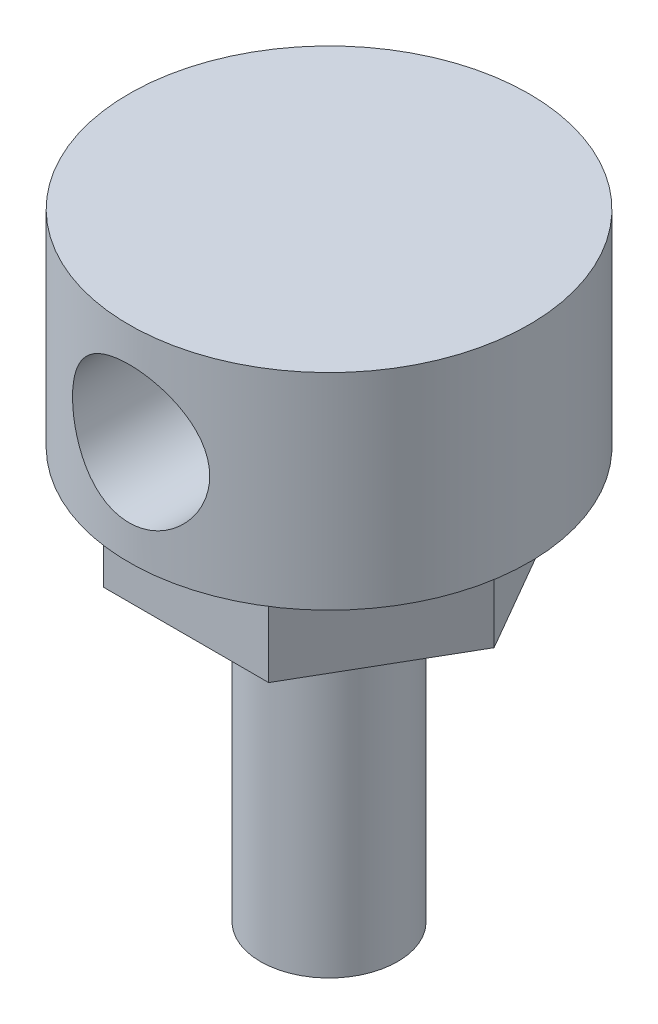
from build123d import *

# Parameters (mm, degrees)
BOSS_EXTRUDE1_DEPTH        = 8
SKETCH2_R                  = 17.5
BOSS_EXTRUDE2_DEPTH        = 18
SKETCH3_R                  = 6
BOSS_EXTRUDE3_DEPTH        = 28
CUT_EXTRUDE1_DEPTH         = 38.369773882
CUT_EXTRUDE1_DEPTH_BACK    = 38.369773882
SKETCH4_R                  = 6
M10X1_5_TAPPED_HOLE1_D     = 8.5
M10X1_5_TAPPED_HOLE1_DEPTH = 20
M10X1_5_TAPPED_HOLE1_TIP   = 2.553657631


with BuildPart() as part:
    # Sketch1 → Boss-Extrude1 (new body)
    with BuildSketch(Plane(origin=(0, 0, 0), x_dir=(1, 0, 0), z_dir=(0, 1, 0))):
        Polygon((14.43375673, 0), (7.216878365, 12.5), (-7.216878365, 12.5), (-14.43375673, 0), (-7.216878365, -12.5), (7.216878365, -12.5), align=None)
    extrude(amount=BOSS_EXTRUDE1_DEPTH)

    # Sketch2 → Boss-Extrude2 (add)
    with BuildSketch(Plane.XZ.offset(-8)):
        with Locations(Location((0, 0, 0), (0, 0, 270))):
            Circle(SKETCH2_R)
    extrude(amount=-BOSS_EXTRUDE2_DEPTH)

    # Sketch3 → Boss-Extrude3 (add)
    with BuildSketch(Plane(origin=(0, 0, 0), x_dir=(1, 0, 0), z_dir=(0, 1, 0))):
        with Locations(Location((0, 0, 0), (0, 0, 270))):
            Circle(SKETCH3_R)
    extrude(amount=-BOSS_EXTRUDE3_DEPTH)

    # Sketch4 → Cut-Extrude1 (cut, two sides: drawn at the far end of the back side and taken through both)
    with BuildSketch(Plane.XY.offset(-CUT_EXTRUDE1_DEPTH_BACK)):
        with Locations((0, 17)):
            Circle(SKETCH4_R)
    extrude(amount=CUT_EXTRUDE1_DEPTH + CUT_EXTRUDE1_DEPTH_BACK, mode=Mode.SUBTRACT)

    # M10x1.5 Tapped Hole1
    with Locations(Plane(origin=(0, -28, 0), x_dir=(-1, 0, 0), z_dir=(0, -1, 0))):
        with Locations((0, 0)):
            Hole(M10X1_5_TAPPED_HOLE1_D / 2, depth=M10X1_5_TAPPED_HOLE1_DEPTH)
            with Locations((0, 0, -(M10X1_5_TAPPED_HOLE1_DEPTH + M10X1_5_TAPPED_HOLE1_TIP / 2))):  # 118° drill point
                Cone(0, M10X1_5_TAPPED_HOLE1_D / 2, M10X1_5_TAPPED_HOLE1_TIP, mode=Mode.SUBTRACT)


solid = part.part
